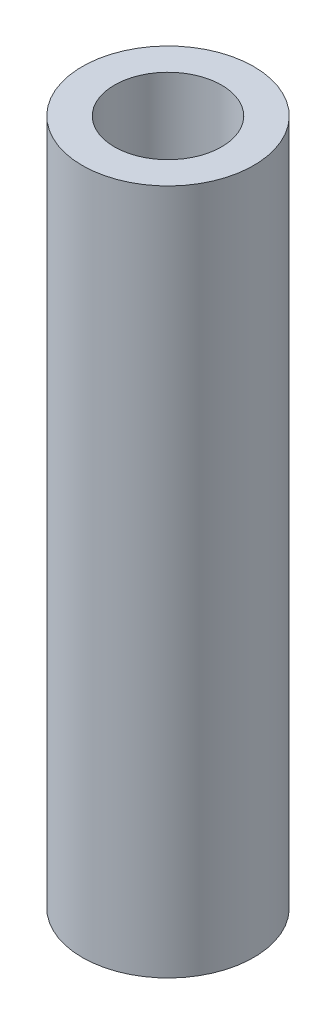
from build123d import *

# Parameters (mm, degrees)
SKETCH1_R      = 4
SKETCH1_R_2    = 2.5
EXTRUDE1_DEPTH = 32


with BuildPart() as part:
    # Sketch1 → Extrude1 (new body)
    with BuildSketch(Plane(origin=(0, 0, 0), x_dir=(1, 0, 0), z_dir=(0, 1, 0))):
        with Locations(Location((0, 0, 0), (0, 0, 270))):
            Circle(SKETCH1_R)
        with Locations(Location((0, 0, 0), (0, 0, 270))):
            Circle(SKETCH1_R_2, mode=Mode.SUBTRACT)
    extrude(amount=EXTRUDE1_DEPTH)


solid = part.part
